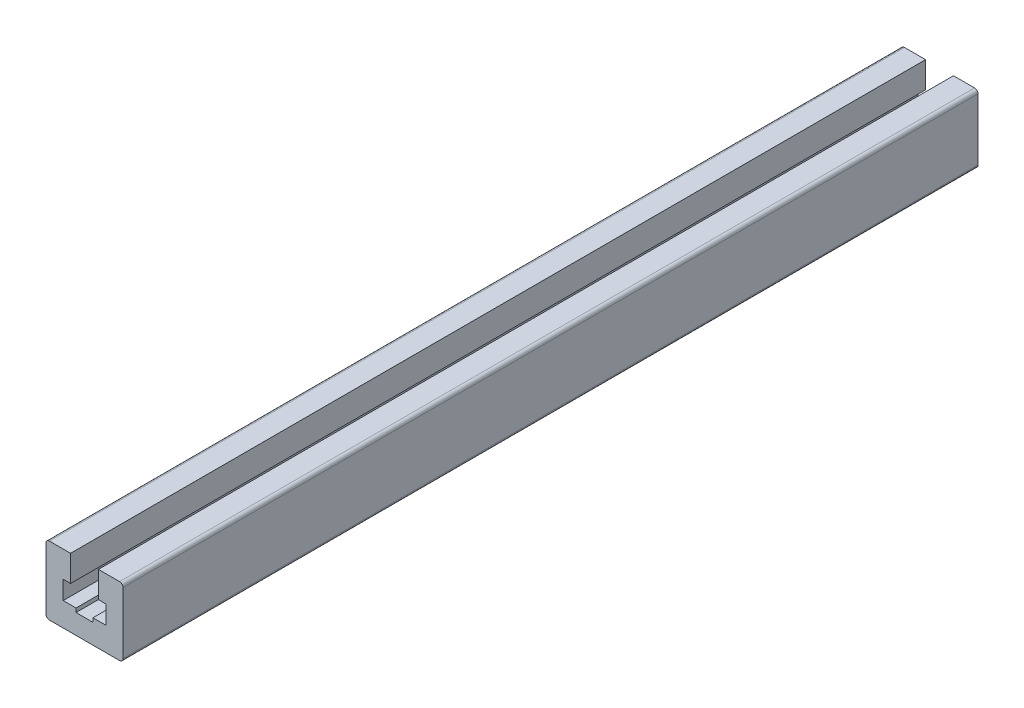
ISO-10303-21;
HEADER;
FILE_DESCRIPTION(('STEP AP214'),'2;1');
FILE_NAME('part.step','',(''),(''),'','','');
FILE_SCHEMA(('AUTOMOTIVE_DESIGN { 1 0 10303 214 1 1 1 1 }'));
ENDSEC;
DATA;
#1=APPLICATION_CONTEXT('core data for automotive mechanical design processes');
#2=APPLICATION_PROTOCOL_DEFINITION('international standard','automotive_design',2000,#1);
#3=PRODUCT_CONTEXT('',#1,'mechanical');
#4=PRODUCT('Part','Part','',(#3));
#5=PRODUCT_RELATED_PRODUCT_CATEGORY('part','',(#4));
#6=PRODUCT_DEFINITION_FORMATION('','',#4);
#7=PRODUCT_DEFINITION_CONTEXT('part definition',#1,'design');
#8=PRODUCT_DEFINITION('design','',#6,#7);
#9=PRODUCT_DEFINITION_SHAPE('','',#8);
#10=(LENGTH_UNIT() NAMED_UNIT(*) SI_UNIT(.MILLI.,.METRE.));
#11=(NAMED_UNIT(*) PLANE_ANGLE_UNIT() SI_UNIT($,.RADIAN.));
#12=(NAMED_UNIT(*) SI_UNIT($,.STERADIAN.) SOLID_ANGLE_UNIT());
#13=UNCERTAINTY_MEASURE_WITH_UNIT(LENGTH_MEASURE(1.E-05),#10,'distance_accuracy_value','');
#14=(GEOMETRIC_REPRESENTATION_CONTEXT(3) GLOBAL_UNCERTAINTY_ASSIGNED_CONTEXT((#13)) GLOBAL_UNIT_ASSIGNED_CONTEXT((#10,
#11,#12)) REPRESENTATION_CONTEXT('',''));
#15=CARTESIAN_POINT('',(0.,0.,0.));
#16=DIRECTION('',(0.,0.,1.));
#17=DIRECTION('',(1.,0.,0.));
#18=AXIS2_PLACEMENT_3D('',#15,#16,#17);
#19=CARTESIAN_POINT('',(-12.4500000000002,13.9000000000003,0.));
#20=DIRECTION('',(0.,-1.,0.));
#21=DIRECTION('',(1.,0.,0.));
#22=AXIS2_PLACEMENT_3D('',#19,#20,#21);
#23=PLANE('',#22);
#24=DIRECTION('',(1.,0.,0.));
#25=VECTOR('',#24,1.);
#26=CARTESIAN_POINT('',(-12.4500000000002,13.9000000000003,0.));
#27=LINE('',#26,#25);
#28=CARTESIAN_POINT('',(4.95,13.9000000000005,0.));
#29=VERTEX_POINT('',#28);
#30=CARTESIAN_POINT('',(12.4500000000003,13.9000000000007,0.));
#31=VERTEX_POINT('',#30);
#32=EDGE_CURVE('E228',#29,#31,#27,.T.);
#33=ORIENTED_EDGE('',*,*,#32,.F.);
#34=DIRECTION('',(0.,0.,1.));
#35=VECTOR('',#34,1.);
#36=CARTESIAN_POINT('',(4.95,13.9000000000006,0.));
#37=LINE('',#36,#35);
#38=CARTESIAN_POINT('',(4.95,13.9000000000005,500.));
#39=VERTEX_POINT('',#38);
#40=EDGE_CURVE('E294',#29,#39,#37,.T.);
#41=ORIENTED_EDGE('',*,*,#40,.T.);
#42=DIRECTION('',(1.,0.,0.));
#43=VECTOR('',#42,1.);
#44=CARTESIAN_POINT('',(-12.4500000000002,13.9000000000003,500.));
#45=LINE('',#44,#43);
#46=CARTESIAN_POINT('',(12.4500000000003,13.9000000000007,500.));
#47=VERTEX_POINT('',#46);
#48=EDGE_CURVE('E170',#39,#47,#45,.T.);
#49=ORIENTED_EDGE('',*,*,#48,.T.);
#50=DIRECTION('',(0.,0.,1.));
#51=VECTOR('',#50,1.);
#52=CARTESIAN_POINT('',(12.4500000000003,13.9000000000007,0.));
#53=LINE('',#52,#51);
#54=EDGE_CURVE('E268',#31,#47,#53,.T.);
#55=ORIENTED_EDGE('',*,*,#54,.F.);
#56=EDGE_LOOP('',(#33,#41,#49,#55));
#57=FACE_BOUND('',#56,.T.);
#58=ADVANCED_FACE('F14',(#57),#23,.F.);
#59=CARTESIAN_POINT('',(20.5,2.,0.));
#60=DIRECTION('',(0.,0.,1.));
#61=DIRECTION('',(1.,0.,0.));
#62=AXIS2_PLACEMENT_3D('',#59,#60,#61);
#63=CYLINDRICAL_SURFACE('',#62,2.);
#64=DIRECTION('',(0.,0.,1.));
#65=VECTOR('',#64,1.);
#66=CARTESIAN_POINT('',(20.5,0.,0.));
#67=LINE('',#66,#65);
#68=CARTESIAN_POINT('',(20.5,0.,0.));
#69=VERTEX_POINT('',#68);
#70=CARTESIAN_POINT('',(20.5,0.,500.));
#71=VERTEX_POINT('',#70);
#72=EDGE_CURVE('E22',#69,#71,#67,.T.);
#73=ORIENTED_EDGE('',*,*,#72,.F.);
#74=CARTESIAN_POINT('',(20.5,2.,0.));
#75=DIRECTION('',(0.,0.,1.));
#76=DIRECTION('',(1.,0.,0.));
#77=AXIS2_PLACEMENT_3D('',#74,#75,#76);
#78=CIRCLE('',#77,2.);
#79=CARTESIAN_POINT('',(22.5,2.,0.));
#80=VERTEX_POINT('',#79);
#81=EDGE_CURVE('E208',#69,#80,#78,.T.);
#82=ORIENTED_EDGE('',*,*,#81,.T.);
#83=DIRECTION('',(0.,0.,1.));
#84=VECTOR('',#83,1.);
#85=CARTESIAN_POINT('',(22.5,2.,0.));
#86=LINE('',#85,#84);
#87=CARTESIAN_POINT('',(22.5,2.,500.));
#88=VERTEX_POINT('',#87);
#89=EDGE_CURVE('E256',#80,#88,#86,.T.);
#90=ORIENTED_EDGE('',*,*,#89,.T.);
#91=CARTESIAN_POINT('',(20.5,2.,500.));
#92=DIRECTION('',(0.,0.,1.));
#93=DIRECTION('',(1.,0.,0.));
#94=AXIS2_PLACEMENT_3D('',#91,#92,#93);
#95=CIRCLE('',#94,2.);
#96=EDGE_CURVE('E289',#71,#88,#95,.T.);
#97=ORIENTED_EDGE('',*,*,#96,.F.);
#98=EDGE_LOOP('',(#73,#82,#90,#97));
#99=FACE_BOUND('',#98,.T.);
#100=ADVANCED_FACE('F290',(#99),#63,.T.);
#101=CARTESIAN_POINT('',(20.5,0.,0.));
#102=DIRECTION('',(0.,1.,0.));
#103=DIRECTION('',(-1.,0.,0.));
#104=AXIS2_PLACEMENT_3D('',#101,#102,#103);
#105=PLANE('',#104);
#106=DIRECTION('',(0.,0.,1.));
#107=VECTOR('',#106,1.);
#108=CARTESIAN_POINT('',(-20.5,0.,0.));
#109=LINE('',#108,#107);
#110=CARTESIAN_POINT('',(-20.5,0.,0.));
#111=VERTEX_POINT('',#110);
#112=CARTESIAN_POINT('',(-20.5,0.,500.));
#113=VERTEX_POINT('',#112);
#114=EDGE_CURVE('E284',#111,#113,#109,.T.);
#115=ORIENTED_EDGE('',*,*,#114,.F.);
#116=DIRECTION('',(-1.,0.,0.));
#117=VECTOR('',#116,1.);
#118=CARTESIAN_POINT('',(20.5,0.,0.));
#119=LINE('',#118,#117);
#120=EDGE_CURVE('E253',#69,#111,#119,.T.);
#121=ORIENTED_EDGE('',*,*,#120,.F.);
#122=ORIENTED_EDGE('',*,*,#72,.T.);
#123=DIRECTION('',(-1.,0.,0.));
#124=VECTOR('',#123,1.);
#125=CARTESIAN_POINT('',(20.5,0.,500.));
#126=LINE('',#125,#124);
#127=EDGE_CURVE('E205',#71,#113,#126,.T.);
#128=ORIENTED_EDGE('',*,*,#127,.T.);
#129=EDGE_LOOP('',(#115,#121,#122,#128));
#130=FACE_BOUND('',#129,.T.);
#131=ADVANCED_FACE('F16',(#130),#105,.F.);
#132=CARTESIAN_POINT('',(-20.5,2.,0.));
#133=DIRECTION('',(0.,0.,1.));
#134=DIRECTION('',(1.,0.,0.));
#135=AXIS2_PLACEMENT_3D('',#132,#133,#134);
#136=CYLINDRICAL_SURFACE('',#135,2.);
#137=DIRECTION('',(0.,0.,1.));
#138=VECTOR('',#137,1.);
#139=CARTESIAN_POINT('',(-22.5,2.,0.));
#140=LINE('',#139,#138);
#141=CARTESIAN_POINT('',(-22.5,2.,0.));
#142=VERTEX_POINT('',#141);
#143=CARTESIAN_POINT('',(-22.5,2.,500.));
#144=VERTEX_POINT('',#143);
#145=EDGE_CURVE('E282',#142,#144,#140,.T.);
#146=ORIENTED_EDGE('',*,*,#145,.F.);
#147=CARTESIAN_POINT('',(-20.5,2.,0.));
#148=DIRECTION('',(0.,0.,1.));
#149=DIRECTION('',(1.,0.,0.));
#150=AXIS2_PLACEMENT_3D('',#147,#148,#149);
#151=CIRCLE('',#150,2.);
#152=EDGE_CURVE('E250',#142,#111,#151,.T.);
#153=ORIENTED_EDGE('',*,*,#152,.T.);
#154=ORIENTED_EDGE('',*,*,#114,.T.);
#155=CARTESIAN_POINT('',(-20.5,2.,500.));
#156=DIRECTION('',(0.,0.,1.));
#157=DIRECTION('',(1.,0.,0.));
#158=AXIS2_PLACEMENT_3D('',#155,#156,#157);
#159=CIRCLE('',#158,2.);
#160=EDGE_CURVE('E202',#144,#113,#159,.T.);
#161=ORIENTED_EDGE('',*,*,#160,.F.);
#162=EDGE_LOOP('',(#146,#153,#154,#161));
#163=FACE_BOUND('',#162,.T.);
#164=ADVANCED_FACE('F299',(#163),#136,.T.);
#165=CARTESIAN_POINT('',(-22.5,38.,0.));
#166=DIRECTION('',(-1.,0.,0.));
#167=DIRECTION('',(0.,-1.,0.));
#168=AXIS2_PLACEMENT_3D('',#165,#166,#167);
#169=PLANE('',#168);
#170=DIRECTION('',(0.,0.,1.));
#171=VECTOR('',#170,1.);
#172=CARTESIAN_POINT('',(-22.5,38.,0.));
#173=LINE('',#172,#171);
#174=CARTESIAN_POINT('',(-22.5,38.,0.));
#175=VERTEX_POINT('',#174);
#176=CARTESIAN_POINT('',(-22.5,38.,500.));
#177=VERTEX_POINT('',#176);
#178=EDGE_CURVE('E280',#175,#177,#173,.T.);
#179=ORIENTED_EDGE('',*,*,#178,.F.);
#180=DIRECTION('',(0.,-1.,0.));
#181=VECTOR('',#180,1.);
#182=CARTESIAN_POINT('',(-22.5,38.,0.));
#183=LINE('',#182,#181);
#184=EDGE_CURVE('E247',#175,#142,#183,.T.);
#185=ORIENTED_EDGE('',*,*,#184,.T.);
#186=ORIENTED_EDGE('',*,*,#145,.T.);
#187=DIRECTION('',(0.,-1.,0.));
#188=VECTOR('',#187,1.);
#189=CARTESIAN_POINT('',(-22.5,38.,500.));
#190=LINE('',#189,#188);
#191=EDGE_CURVE('E199',#177,#144,#190,.T.);
#192=ORIENTED_EDGE('',*,*,#191,.F.);
#193=EDGE_LOOP('',(#179,#185,#186,#192));
#194=FACE_BOUND('',#193,.T.);
#195=ADVANCED_FACE('F366',(#194),#169,.T.);
#196=CARTESIAN_POINT('',(-20.5,38.,0.));
#197=DIRECTION('',(0.,0.,1.));
#198=DIRECTION('',(1.,0.,0.));
#199=AXIS2_PLACEMENT_3D('',#196,#197,#198);
#200=CYLINDRICAL_SURFACE('',#199,2.);
#201=DIRECTION('',(0.,0.,1.));
#202=VECTOR('',#201,1.);
#203=CARTESIAN_POINT('',(-20.5,40.,0.));
#204=LINE('',#203,#202);
#205=CARTESIAN_POINT('',(-20.5,40.,0.));
#206=VERTEX_POINT('',#205);
#207=CARTESIAN_POINT('',(-20.5,40.,500.));
#208=VERTEX_POINT('',#207);
#209=EDGE_CURVE('E278',#206,#208,#204,.T.);
#210=ORIENTED_EDGE('',*,*,#209,.F.);
#211=CARTESIAN_POINT('',(-20.5,38.,0.));
#212=DIRECTION('',(0.,0.,1.));
#213=DIRECTION('',(1.,0.,0.));
#214=AXIS2_PLACEMENT_3D('',#211,#212,#213);
#215=CIRCLE('',#214,2.);
#216=EDGE_CURVE('E244',#206,#175,#215,.T.);
#217=ORIENTED_EDGE('',*,*,#216,.T.);
#218=ORIENTED_EDGE('',*,*,#178,.T.);
#219=CARTESIAN_POINT('',(-20.5,38.,500.));
#220=DIRECTION('',(0.,0.,1.));
#221=DIRECTION('',(1.,0.,0.));
#222=AXIS2_PLACEMENT_3D('',#219,#220,#221);
#223=CIRCLE('',#222,2.);
#224=EDGE_CURVE('E196',#208,#177,#223,.T.);
#225=ORIENTED_EDGE('',*,*,#224,.F.);
#226=EDGE_LOOP('',(#210,#217,#218,#225));
#227=FACE_BOUND('',#226,.T.);
#228=ADVANCED_FACE('F364',(#227),#200,.T.);
#229=CARTESIAN_POINT('',(-8.15000000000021,40.,0.));
#230=DIRECTION('',(0.,1.,0.));
#231=DIRECTION('',(-1.,0.,0.));
#232=AXIS2_PLACEMENT_3D('',#229,#230,#231);
#233=PLANE('',#232);
#234=DIRECTION('',(0.,0.,1.));
#235=VECTOR('',#234,1.);
#236=CARTESIAN_POINT('',(-8.15000000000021,40.,0.));
#237=LINE('',#236,#235);
#238=CARTESIAN_POINT('',(-8.15000000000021,40.,0.));
#239=VERTEX_POINT('',#238);
#240=CARTESIAN_POINT('',(-8.15000000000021,40.,500.));
#241=VERTEX_POINT('',#240);
#242=EDGE_CURVE('E276',#239,#241,#237,.T.);
#243=ORIENTED_EDGE('',*,*,#242,.F.);
#244=DIRECTION('',(-1.,0.,0.));
#245=VECTOR('',#244,1.);
#246=CARTESIAN_POINT('',(-8.15000000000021,40.,0.));
#247=LINE('',#246,#245);
#248=EDGE_CURVE('E241',#239,#206,#247,.T.);
#249=ORIENTED_EDGE('',*,*,#248,.T.);
#250=ORIENTED_EDGE('',*,*,#209,.T.);
#251=DIRECTION('',(-1.,0.,0.));
#252=VECTOR('',#251,1.);
#253=CARTESIAN_POINT('',(-8.15000000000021,40.,500.));
#254=LINE('',#253,#252);
#255=EDGE_CURVE('E193',#241,#208,#254,.T.);
#256=ORIENTED_EDGE('',*,*,#255,.F.);
#257=EDGE_LOOP('',(#243,#249,#250,#256));
#258=FACE_BOUND('',#257,.T.);
#259=ADVANCED_FACE('F361',(#258),#233,.T.);
#260=CARTESIAN_POINT('',(-8.15000000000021,40.,0.));
#261=DIRECTION('',(-1.,0.,0.));
#262=DIRECTION('',(0.,0.,1.));
#263=AXIS2_PLACEMENT_3D('',#260,#261,#262);
#264=PLANE('',#263);
#265=DIRECTION('',(0.,0.,1.));
#266=VECTOR('',#265,1.);
#267=CARTESIAN_POINT('',(-8.15000000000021,24.7,0.));
#268=LINE('',#267,#266);
#269=CARTESIAN_POINT('',(-8.15000000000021,24.7,0.));
#270=VERTEX_POINT('',#269);
#271=CARTESIAN_POINT('',(-8.15000000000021,24.7,500.));
#272=VERTEX_POINT('',#271);
#273=EDGE_CURVE('E274',#270,#272,#268,.T.);
#274=ORIENTED_EDGE('',*,*,#273,.F.);
#275=DIRECTION('',(0.,-1.,0.));
#276=VECTOR('',#275,1.);
#277=CARTESIAN_POINT('',(-8.15000000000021,40.,0.));
#278=LINE('',#277,#276);
#279=EDGE_CURVE('E238',#239,#270,#278,.T.);
#280=ORIENTED_EDGE('',*,*,#279,.F.);
#281=ORIENTED_EDGE('',*,*,#242,.T.);
#282=DIRECTION('',(0.,-1.,0.));
#283=VECTOR('',#282,1.);
#284=CARTESIAN_POINT('',(-8.15000000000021,40.,500.));
#285=LINE('',#284,#283);
#286=EDGE_CURVE('E190',#241,#272,#285,.T.);
#287=ORIENTED_EDGE('',*,*,#286,.T.);
#288=EDGE_LOOP('',(#274,#280,#281,#287));
#289=FACE_BOUND('',#288,.T.);
#290=ADVANCED_FACE('F356',(#289),#264,.F.);
#291=CARTESIAN_POINT('',(-8.15000000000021,24.7,0.));
#292=DIRECTION('',(0.,1.,0.));
#293=DIRECTION('',(-1.,0.,0.));
#294=AXIS2_PLACEMENT_3D('',#291,#292,#293);
#295=PLANE('',#294);
#296=DIRECTION('',(0.,0.,1.));
#297=VECTOR('',#296,1.);
#298=CARTESIAN_POINT('',(-12.4500000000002,24.7,0.));
#299=LINE('',#298,#297);
#300=CARTESIAN_POINT('',(-12.4500000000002,24.7,0.));
#301=VERTEX_POINT('',#300);
#302=CARTESIAN_POINT('',(-12.4500000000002,24.7,500.));
#303=VERTEX_POINT('',#302);
#304=EDGE_CURVE('E272',#301,#303,#299,.T.);
#305=ORIENTED_EDGE('',*,*,#304,.F.);
#306=DIRECTION('',(-1.,0.,0.));
#307=VECTOR('',#306,1.);
#308=CARTESIAN_POINT('',(-8.15000000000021,24.7,0.));
#309=LINE('',#308,#307);
#310=EDGE_CURVE('E235',#270,#301,#309,.T.);
#311=ORIENTED_EDGE('',*,*,#310,.F.);
#312=ORIENTED_EDGE('',*,*,#273,.T.);
#313=DIRECTION('',(-1.,0.,0.));
#314=VECTOR('',#313,1.);
#315=CARTESIAN_POINT('',(-8.15000000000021,24.7,500.));
#316=LINE('',#315,#314);
#317=EDGE_CURVE('E187',#272,#303,#316,.T.);
#318=ORIENTED_EDGE('',*,*,#317,.T.);
#319=EDGE_LOOP('',(#305,#311,#312,#318));
#320=FACE_BOUND('',#319,.T.);
#321=ADVANCED_FACE('F353',(#320),#295,.F.);
#322=CARTESIAN_POINT('',(-12.4500000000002,24.7,0.));
#323=DIRECTION('',(-1.,0.,0.));
#324=DIRECTION('',(0.,0.,1.));
#325=AXIS2_PLACEMENT_3D('',#322,#323,#324);
#326=PLANE('',#325);
#327=DIRECTION('',(0.,0.,1.));
#328=VECTOR('',#327,1.);
#329=CARTESIAN_POINT('',(-12.4500000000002,13.9000000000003,0.));
#330=LINE('',#329,#328);
#331=CARTESIAN_POINT('',(-12.4500000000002,13.9000000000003,0.));
#332=VERTEX_POINT('',#331);
#333=CARTESIAN_POINT('',(-12.4500000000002,13.9000000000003,500.));
#334=VERTEX_POINT('',#333);
#335=EDGE_CURVE('E270',#332,#334,#330,.T.);
#336=ORIENTED_EDGE('',*,*,#335,.F.);
#337=DIRECTION('',(0.,-1.,0.));
#338=VECTOR('',#337,1.);
#339=CARTESIAN_POINT('',(-12.4500000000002,24.7,0.));
#340=LINE('',#339,#338);
#341=EDGE_CURVE('E232',#301,#332,#340,.T.);
#342=ORIENTED_EDGE('',*,*,#341,.F.);
#343=ORIENTED_EDGE('',*,*,#304,.T.);
#344=DIRECTION('',(0.,-1.,0.));
#345=VECTOR('',#344,1.);
#346=CARTESIAN_POINT('',(-12.4500000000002,24.7,500.));
#347=LINE('',#346,#345);
#348=EDGE_CURVE('E180',#303,#334,#347,.T.);
#349=ORIENTED_EDGE('',*,*,#348,.T.);
#350=EDGE_LOOP('',(#336,#342,#343,#349));
#351=FACE_BOUND('',#350,.T.);
#352=ADVANCED_FACE('F348',(#351),#326,.F.);
#353=CARTESIAN_POINT('',(-4.95,13.9000000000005,500.));
#354=VERTEX_POINT('',#353);
#355=EDGE_CURVE('E177',#334,#354,#45,.T.);
#356=ORIENTED_EDGE('',*,*,#355,.T.);
#357=DIRECTION('',(0.,0.,-1.));
#358=VECTOR('',#357,1.);
#359=CARTESIAN_POINT('',(-4.95,13.9000000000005,0.));
#360=LINE('',#359,#358);
#361=CARTESIAN_POINT('',(-4.95,13.9000000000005,0.));
#362=VERTEX_POINT('',#361);
#363=EDGE_CURVE('E338',#354,#362,#360,.T.);
#364=ORIENTED_EDGE('',*,*,#363,.T.);
#365=EDGE_CURVE('E229',#332,#362,#27,.T.);
#366=ORIENTED_EDGE('',*,*,#365,.F.);
#367=ORIENTED_EDGE('',*,*,#335,.T.);
#368=EDGE_LOOP('',(#356,#364,#366,#367));
#369=FACE_BOUND('',#368,.T.);
#370=ADVANCED_FACE('F343',(#369),#23,.F.);
#371=CARTESIAN_POINT('',(12.4500000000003,13.9000000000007,0.));
#372=DIRECTION('',(1.,0.,0.));
#373=DIRECTION('',(0.,1.,0.));
#374=AXIS2_PLACEMENT_3D('',#371,#372,#373);
#375=PLANE('',#374);
#376=DIRECTION('',(0.,0.,1.));
#377=VECTOR('',#376,1.);
#378=CARTESIAN_POINT('',(12.4500000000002,24.7000000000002,0.));
#379=LINE('',#378,#377);
#380=CARTESIAN_POINT('',(12.4500000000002,24.7000000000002,0.));
#381=VERTEX_POINT('',#380);
#382=CARTESIAN_POINT('',(12.4500000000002,24.7000000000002,500.));
#383=VERTEX_POINT('',#382);
#384=EDGE_CURVE('E266',#381,#383,#379,.T.);
#385=ORIENTED_EDGE('',*,*,#384,.F.);
#386=DIRECTION('',(0.,1.,0.));
#387=VECTOR('',#386,1.);
#388=CARTESIAN_POINT('',(12.4500000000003,13.9000000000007,0.));
#389=LINE('',#388,#387);
#390=EDGE_CURVE('E225',#31,#381,#389,.T.);
#391=ORIENTED_EDGE('',*,*,#390,.F.);
#392=ORIENTED_EDGE('',*,*,#54,.T.);
#393=DIRECTION('',(0.,1.,0.));
#394=VECTOR('',#393,1.);
#395=CARTESIAN_POINT('',(12.4500000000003,13.9000000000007,500.));
#396=LINE('',#395,#394);
#397=EDGE_CURVE('E173',#47,#383,#396,.T.);
#398=ORIENTED_EDGE('',*,*,#397,.T.);
#399=EDGE_LOOP('',(#385,#391,#392,#398));
#400=FACE_BOUND('',#399,.T.);
#401=ADVANCED_FACE('F328',(#400),#375,.F.);
#402=CARTESIAN_POINT('',(12.4500000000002,24.7000000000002,0.));
#403=DIRECTION('',(0.,1.,0.));
#404=DIRECTION('',(0.,0.,1.));
#405=AXIS2_PLACEMENT_3D('',#402,#403,#404);
#406=PLANE('',#405);
#407=DIRECTION('',(0.,0.,1.));
#408=VECTOR('',#407,1.);
#409=CARTESIAN_POINT('',(8.1500000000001,24.7000000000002,0.));
#410=LINE('',#409,#408);
#411=CARTESIAN_POINT('',(8.1500000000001,24.7000000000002,0.));
#412=VERTEX_POINT('',#411);
#413=CARTESIAN_POINT('',(8.1500000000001,24.7000000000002,500.));
#414=VERTEX_POINT('',#413);
#415=EDGE_CURVE('E264',#412,#414,#410,.T.);
#416=ORIENTED_EDGE('',*,*,#415,.F.);
#417=DIRECTION('',(-1.,0.,0.));
#418=VECTOR('',#417,1.);
#419=CARTESIAN_POINT('',(12.4500000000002,24.7000000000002,0.));
#420=LINE('',#419,#418);
#421=EDGE_CURVE('E222',#381,#412,#420,.T.);
#422=ORIENTED_EDGE('',*,*,#421,.F.);
#423=ORIENTED_EDGE('',*,*,#384,.T.);
#424=DIRECTION('',(-1.,0.,0.));
#425=VECTOR('',#424,1.);
#426=CARTESIAN_POINT('',(12.4500000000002,24.7000000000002,500.));
#427=LINE('',#426,#425);
#428=EDGE_CURVE('E181',#383,#414,#427,.T.);
#429=ORIENTED_EDGE('',*,*,#428,.T.);
#430=EDGE_LOOP('',(#416,#422,#423,#429));
#431=FACE_BOUND('',#430,.T.);
#432=ADVANCED_FACE('F323',(#431),#406,.F.);
#433=CARTESIAN_POINT('',(8.1500000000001,24.7000000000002,0.));
#434=DIRECTION('',(1.,0.,0.));
#435=DIRECTION('',(0.,0.,-1.));
#436=AXIS2_PLACEMENT_3D('',#433,#434,#435);
#437=PLANE('',#436);
#438=DIRECTION('',(0.,0.,1.));
#439=VECTOR('',#438,1.);
#440=CARTESIAN_POINT('',(8.1500000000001,40.,0.));
#441=LINE('',#440,#439);
#442=CARTESIAN_POINT('',(8.1500000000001,40.,0.));
#443=VERTEX_POINT('',#442);
#444=CARTESIAN_POINT('',(8.1500000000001,40.,500.));
#445=VERTEX_POINT('',#444);
#446=EDGE_CURVE('E262',#443,#445,#441,.T.);
#447=ORIENTED_EDGE('',*,*,#446,.F.);
#448=DIRECTION('',(0.,1.,0.));
#449=VECTOR('',#448,1.);
#450=CARTESIAN_POINT('',(8.1500000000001,24.7000000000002,0.));
#451=LINE('',#450,#449);
#452=EDGE_CURVE('E219',#412,#443,#451,.T.);
#453=ORIENTED_EDGE('',*,*,#452,.F.);
#454=ORIENTED_EDGE('',*,*,#415,.T.);
#455=DIRECTION('',(0.,1.,0.));
#456=VECTOR('',#455,1.);
#457=CARTESIAN_POINT('',(8.1500000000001,24.7000000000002,500.));
#458=LINE('',#457,#456);
#459=EDGE_CURVE('E319',#414,#445,#458,.T.);
#460=ORIENTED_EDGE('',*,*,#459,.T.);
#461=EDGE_LOOP('',(#447,#453,#454,#460));
#462=FACE_BOUND('',#461,.T.);
#463=ADVANCED_FACE('F440',(#462),#437,.F.);
#464=CARTESIAN_POINT('',(20.5,40.,0.));
#465=DIRECTION('',(0.,1.,0.));
#466=DIRECTION('',(0.,0.,1.));
#467=AXIS2_PLACEMENT_3D('',#464,#465,#466);
#468=PLANE('',#467);
#469=DIRECTION('',(0.,0.,1.));
#470=VECTOR('',#469,1.);
#471=CARTESIAN_POINT('',(20.5,40.,0.));
#472=LINE('',#471,#470);
#473=CARTESIAN_POINT('',(20.5,40.,0.));
#474=VERTEX_POINT('',#473);
#475=CARTESIAN_POINT('',(20.5,40.,500.));
#476=VERTEX_POINT('',#475);
#477=EDGE_CURVE('E260',#474,#476,#472,.T.);
#478=ORIENTED_EDGE('',*,*,#477,.F.);
#479=DIRECTION('',(-1.,0.,0.));
#480=VECTOR('',#479,1.);
#481=CARTESIAN_POINT('',(20.5,40.,0.));
#482=LINE('',#481,#480);
#483=EDGE_CURVE('E216',#474,#443,#482,.T.);
#484=ORIENTED_EDGE('',*,*,#483,.T.);
#485=ORIENTED_EDGE('',*,*,#446,.T.);
#486=DIRECTION('',(-1.,0.,0.));
#487=VECTOR('',#486,1.);
#488=CARTESIAN_POINT('',(20.5,40.,500.));
#489=LINE('',#488,#487);
#490=EDGE_CURVE('E313',#476,#445,#489,.T.);
#491=ORIENTED_EDGE('',*,*,#490,.F.);
#492=EDGE_LOOP('',(#478,#484,#485,#491));
#493=FACE_BOUND('',#492,.T.);
#494=ADVANCED_FACE('F449',(#493),#468,.T.);
#495=CARTESIAN_POINT('',(20.5,38.,0.));
#496=DIRECTION('',(0.,0.,1.));
#497=DIRECTION('',(1.,0.,0.));
#498=AXIS2_PLACEMENT_3D('',#495,#496,#497);
#499=CYLINDRICAL_SURFACE('',#498,2.);
#500=DIRECTION('',(0.,0.,1.));
#501=VECTOR('',#500,1.);
#502=CARTESIAN_POINT('',(22.5,38.,0.));
#503=LINE('',#502,#501);
#504=CARTESIAN_POINT('',(22.5,38.,0.));
#505=VERTEX_POINT('',#504);
#506=CARTESIAN_POINT('',(22.5,38.,500.));
#507=VERTEX_POINT('',#506);
#508=EDGE_CURVE('E258',#505,#507,#503,.T.);
#509=ORIENTED_EDGE('',*,*,#508,.F.);
#510=CARTESIAN_POINT('',(20.5,38.,0.));
#511=DIRECTION('',(0.,0.,1.));
#512=DIRECTION('',(1.,0.,0.));
#513=AXIS2_PLACEMENT_3D('',#510,#511,#512);
#514=CIRCLE('',#513,2.);
#515=EDGE_CURVE('E213',#505,#474,#514,.T.);
#516=ORIENTED_EDGE('',*,*,#515,.T.);
#517=ORIENTED_EDGE('',*,*,#477,.T.);
#518=CARTESIAN_POINT('',(20.5,38.,500.));
#519=DIRECTION('',(0.,0.,1.));
#520=DIRECTION('',(1.,0.,0.));
#521=AXIS2_PLACEMENT_3D('',#518,#519,#520);
#522=CIRCLE('',#521,2.);
#523=EDGE_CURVE('E311',#507,#476,#522,.T.);
#524=ORIENTED_EDGE('',*,*,#523,.F.);
#525=EDGE_LOOP('',(#509,#516,#517,#524));
#526=FACE_BOUND('',#525,.T.);
#527=ADVANCED_FACE('F459',(#526),#499,.T.);
#528=CARTESIAN_POINT('',(22.5,38.,0.));
#529=DIRECTION('',(-1.,0.,0.));
#530=DIRECTION('',(0.,0.,1.));
#531=AXIS2_PLACEMENT_3D('',#528,#529,#530);
#532=PLANE('',#531);
#533=DIRECTION('',(0.,-1.,0.));
#534=VECTOR('',#533,1.);
#535=CARTESIAN_POINT('',(22.5,38.,0.));
#536=LINE('',#535,#534);
#537=EDGE_CURVE('E210',#505,#80,#536,.T.);
#538=ORIENTED_EDGE('',*,*,#537,.F.);
#539=ORIENTED_EDGE('',*,*,#508,.T.);
#540=DIRECTION('',(0.,-1.,0.));
#541=VECTOR('',#540,1.);
#542=CARTESIAN_POINT('',(22.5,38.,500.));
#543=LINE('',#542,#541);
#544=EDGE_CURVE('E293',#507,#88,#543,.T.);
#545=ORIENTED_EDGE('',*,*,#544,.T.);
#546=ORIENTED_EDGE('',*,*,#89,.F.);
#547=EDGE_LOOP('',(#538,#539,#545,#546));
#548=FACE_BOUND('',#547,.T.);
#549=ADVANCED_FACE('F308',(#548),#532,.F.);
#550=CARTESIAN_POINT('',(20.5,2.,0.));
#551=DIRECTION('',(0.,0.,1.));
#552=DIRECTION('',(1.,0.,0.));
#553=AXIS2_PLACEMENT_3D('',#550,#551,#552);
#554=PLANE('',#553);
#555=DIRECTION('',(-1.,0.,0.));
#556=VECTOR('',#555,1.);
#557=CARTESIAN_POINT('',(4.95,11.6,0.));
#558=LINE('',#557,#556);
#559=CARTESIAN_POINT('',(4.95,11.6,0.));
#560=VERTEX_POINT('',#559);
#561=CARTESIAN_POINT('',(-4.95,11.6,0.));
#562=VERTEX_POINT('',#561);
#563=EDGE_CURVE('E332',#560,#562,#558,.T.);
#564=ORIENTED_EDGE('',*,*,#563,.F.);
#565=DIRECTION('',(0.,-1.,0.));
#566=VECTOR('',#565,1.);
#567=CARTESIAN_POINT('',(4.95,21.3059687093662,0.));
#568=LINE('',#567,#566);
#569=EDGE_CURVE('E155',#29,#560,#568,.T.);
#570=ORIENTED_EDGE('',*,*,#569,.F.);
#571=ORIENTED_EDGE('',*,*,#32,.T.);
#572=ORIENTED_EDGE('',*,*,#390,.T.);
#573=ORIENTED_EDGE('',*,*,#421,.T.);
#574=ORIENTED_EDGE('',*,*,#452,.T.);
#575=ORIENTED_EDGE('',*,*,#483,.F.);
#576=ORIENTED_EDGE('',*,*,#515,.F.);
#577=ORIENTED_EDGE('',*,*,#537,.T.);
#578=ORIENTED_EDGE('',*,*,#81,.F.);
#579=ORIENTED_EDGE('',*,*,#120,.T.);
#580=ORIENTED_EDGE('',*,*,#152,.F.);
#581=ORIENTED_EDGE('',*,*,#184,.F.);
#582=ORIENTED_EDGE('',*,*,#216,.F.);
#583=ORIENTED_EDGE('',*,*,#248,.F.);
#584=ORIENTED_EDGE('',*,*,#279,.T.);
#585=ORIENTED_EDGE('',*,*,#310,.T.);
#586=ORIENTED_EDGE('',*,*,#341,.T.);
#587=ORIENTED_EDGE('',*,*,#365,.T.);
#588=DIRECTION('',(0.,1.,0.));
#589=VECTOR('',#588,1.);
#590=CARTESIAN_POINT('',(-4.95,21.3059687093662,0.));
#591=LINE('',#590,#589);
#592=EDGE_CURVE('E165',#562,#362,#591,.T.);
#593=ORIENTED_EDGE('',*,*,#592,.F.);
#594=EDGE_LOOP('',(#564,#570,#571,#572,#573,#574,#575,#576,#577,#578,#579,#580,#581,#582,#583,
#584,#585,#586,#587,#593));
#595=FACE_BOUND('',#594,.T.);
#596=ADVANCED_FACE('F303',(#595),#554,.F.);
#597=CARTESIAN_POINT('',(20.5,2.,500.));
#598=DIRECTION('',(0.,0.,1.));
#599=DIRECTION('',(1.,0.,0.));
#600=AXIS2_PLACEMENT_3D('',#597,#598,#599);
#601=PLANE('',#600);
#602=DIRECTION('',(0.,1.,0.));
#603=VECTOR('',#602,1.);
#604=CARTESIAN_POINT('',(4.95,2.,500.));
#605=LINE('',#604,#603);
#606=CARTESIAN_POINT('',(4.95,11.6,500.));
#607=VERTEX_POINT('',#606);
#608=EDGE_CURVE('E9',#607,#39,#605,.T.);
#609=ORIENTED_EDGE('',*,*,#608,.F.);
#610=DIRECTION('',(-1.,0.,0.));
#611=VECTOR('',#610,1.);
#612=CARTESIAN_POINT('',(4.95,11.6,500.));
#613=LINE('',#612,#611);
#614=CARTESIAN_POINT('',(-4.95,11.6,500.));
#615=VERTEX_POINT('',#614);
#616=EDGE_CURVE('E162',#607,#615,#613,.T.);
#617=ORIENTED_EDGE('',*,*,#616,.T.);
#618=DIRECTION('',(0.,1.,0.));
#619=VECTOR('',#618,1.);
#620=CARTESIAN_POINT('',(-4.95,21.3059687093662,500.));
#621=LINE('',#620,#619);
#622=EDGE_CURVE('E29',#615,#354,#621,.T.);
#623=ORIENTED_EDGE('',*,*,#622,.T.);
#624=ORIENTED_EDGE('',*,*,#355,.F.);
#625=ORIENTED_EDGE('',*,*,#348,.F.);
#626=ORIENTED_EDGE('',*,*,#317,.F.);
#627=ORIENTED_EDGE('',*,*,#286,.F.);
#628=ORIENTED_EDGE('',*,*,#255,.T.);
#629=ORIENTED_EDGE('',*,*,#224,.T.);
#630=ORIENTED_EDGE('',*,*,#191,.T.);
#631=ORIENTED_EDGE('',*,*,#160,.T.);
#632=ORIENTED_EDGE('',*,*,#127,.F.);
#633=ORIENTED_EDGE('',*,*,#96,.T.);
#634=ORIENTED_EDGE('',*,*,#544,.F.);
#635=ORIENTED_EDGE('',*,*,#523,.T.);
#636=ORIENTED_EDGE('',*,*,#490,.T.);
#637=ORIENTED_EDGE('',*,*,#459,.F.);
#638=ORIENTED_EDGE('',*,*,#428,.F.);
#639=ORIENTED_EDGE('',*,*,#397,.F.);
#640=ORIENTED_EDGE('',*,*,#48,.F.);
#641=EDGE_LOOP('',(#609,#617,#623,#624,#625,#626,#627,#628,#629,#630,#631,#632,#633,#634,#635,
#636,#637,#638,#639,#640));
#642=FACE_BOUND('',#641,.T.);
#643=ADVANCED_FACE('F168',(#642),#601,.T.);
#644=CARTESIAN_POINT('',(4.95,21.3059687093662,500.));
#645=DIRECTION('',(1.,0.,0.));
#646=DIRECTION('',(0.,1.,0.));
#647=AXIS2_PLACEMENT_3D('',#644,#645,#646);
#648=PLANE('',#647);
#649=ORIENTED_EDGE('',*,*,#569,.T.);
#650=DIRECTION('',(0.,0.,-1.));
#651=VECTOR('',#650,1.);
#652=CARTESIAN_POINT('',(4.95,11.6,500.));
#653=LINE('',#652,#651);
#654=EDGE_CURVE('E149',#607,#560,#653,.T.);
#655=ORIENTED_EDGE('',*,*,#654,.F.);
#656=ORIENTED_EDGE('',*,*,#608,.T.);
#657=ORIENTED_EDGE('',*,*,#40,.F.);
#658=EDGE_LOOP('',(#649,#655,#656,#657));
#659=FACE_BOUND('',#658,.T.);
#660=ADVANCED_FACE('F151',(#659),#648,.F.);
#661=CARTESIAN_POINT('',(-4.95,21.3059687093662,500.));
#662=DIRECTION('',(-1.,0.,0.));
#663=DIRECTION('',(0.,-1.,0.));
#664=AXIS2_PLACEMENT_3D('',#661,#662,#663);
#665=PLANE('',#664);
#666=ORIENTED_EDGE('',*,*,#622,.F.);
#667=DIRECTION('',(0.,0.,-1.));
#668=VECTOR('',#667,1.);
#669=CARTESIAN_POINT('',(-4.95,11.6,500.));
#670=LINE('',#669,#668);
#671=EDGE_CURVE('E159',#615,#562,#670,.T.);
#672=ORIENTED_EDGE('',*,*,#671,.T.);
#673=ORIENTED_EDGE('',*,*,#592,.T.);
#674=ORIENTED_EDGE('',*,*,#363,.F.);
#675=EDGE_LOOP('',(#666,#672,#673,#674));
#676=FACE_BOUND('',#675,.T.);
#677=ADVANCED_FACE('F503',(#676),#665,.F.);
#678=CARTESIAN_POINT('',(4.95,11.6,500.));
#679=DIRECTION('',(0.,-1.,0.));
#680=DIRECTION('',(0.,0.,-1.));
#681=AXIS2_PLACEMENT_3D('',#678,#679,#680);
#682=PLANE('',#681);
#683=ORIENTED_EDGE('',*,*,#563,.T.);
#684=ORIENTED_EDGE('',*,*,#671,.F.);
#685=ORIENTED_EDGE('',*,*,#616,.F.);
#686=ORIENTED_EDGE('',*,*,#654,.T.);
#687=EDGE_LOOP('',(#683,#684,#685,#686));
#688=FACE_BOUND('',#687,.T.);
#689=ADVANCED_FACE('F163',(#688),#682,.F.);
#690=CLOSED_SHELL('',(#58,#100,#131,#164,#195,#228,#259,#290,#321,#352,#370,#401,#432,#463,#494,
#527,#549,#596,#643,#660,#677,#689));
#691=MANIFOLD_SOLID_BREP('B1',#690);
#692=ADVANCED_BREP_SHAPE_REPRESENTATION('',(#18,#691),#14);
#693=SHAPE_DEFINITION_REPRESENTATION(#9,#692);
ENDSEC;
END-ISO-10303-21;
